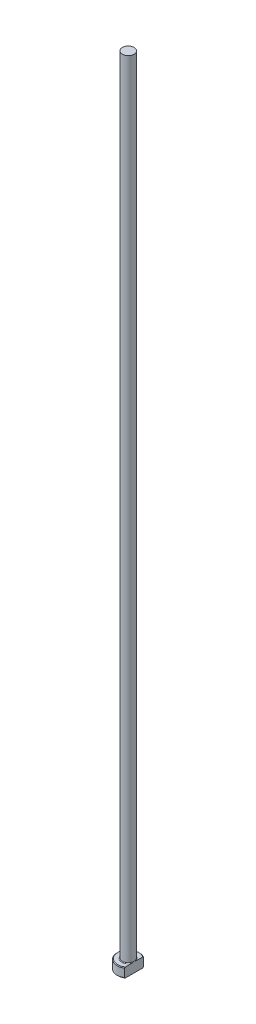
from build123d import *
from build123d.topology import SkipClean

# Parameters (mm, degrees)
CHAMFER1_SIZE = 0.2
FILLET1_R     = 0.2
KEY_DEPTH     = 251.048995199


with BuildPart() as part:
    # Sketch1 → Revolve1 (revolve)
    with BuildSketch(Plane.XY, mode=Mode.PRIVATE) as revolve1_sk:
        Polygon((0, 0), (-3.5, 0), (-3.5, 3), (-1.85, 3), (-1.85, 250), (0, 250), align=None)
    revolve(revolve1_sk.sketch.rotate(Axis((0, 259.958771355, 0), (0, -1, 0)), 270), axis=Axis((0, 259.958771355, 0), (0, -1, 0)))

    # Chamfer1
    chamfer1_edges = [part.edges().sort_by_distance(p)[0] for p in [
        (0, 3, -3.5),
        (0, 0, -3.5),
    ]]
    chamfer(chamfer1_edges, length=CHAMFER1_SIZE)

    # Fillet1
    fillet1_edges = [part.edges().sort_by_distance(p)[0] for p in [
        (0, 3, -1.85),
    ]]
    fillet(fillet1_edges, radius=FILLET1_R)

    # Sketch2 → KEY (cut, through all)
    with SkipClean():  # the faces are left unmerged after this step: merging them gives an invalid solid
        with BuildSketch(Plane(origin=(0, 0, 0), x_dir=(1, 0, 0), z_dir=(0, 1, 0))):
            with BuildLine():
                Line((1.85, 2.971110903), (1.85, -2.971110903))
                ThreePointArc((1.85, -2.971110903), (3.5, 0), (1.85, 2.971110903))
            make_face()
        extrude(amount=KEY_DEPTH, mode=Mode.SUBTRACT)


solid = part.part
